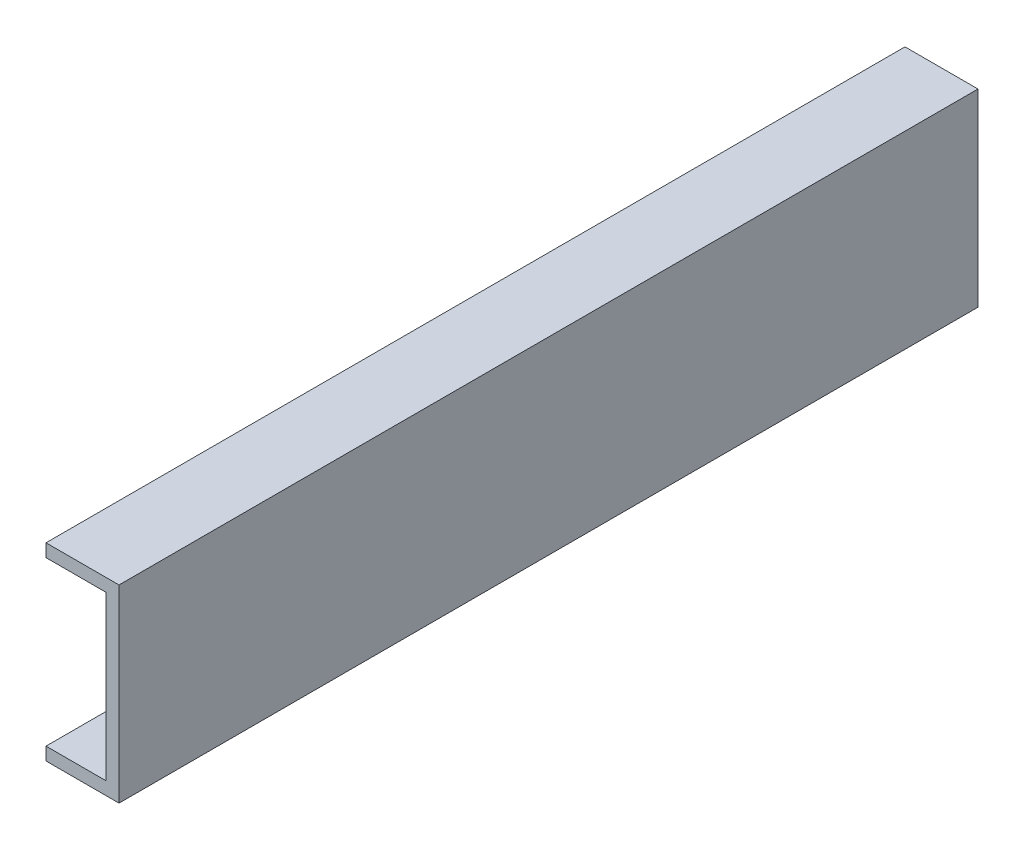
from build123d import *

# Parameters (mm, degrees)
LINEAR_AUSTRAGEN_D_NN1_DEPTH = 200


with BuildPart() as part:
    # Skizze1 → Linear-Austragen-D_nn1 (new body)
    with BuildSketch(Plane.XY):
        Polygon((-17, 22), (0, 22), (0, -22), (-17, -22), (-17, -19), (-3, -19), (-3, 19), (-17, 19), align=None)
    extrude(amount=LINEAR_AUSTRAGEN_D_NN1_DEPTH)


solid = part.part
